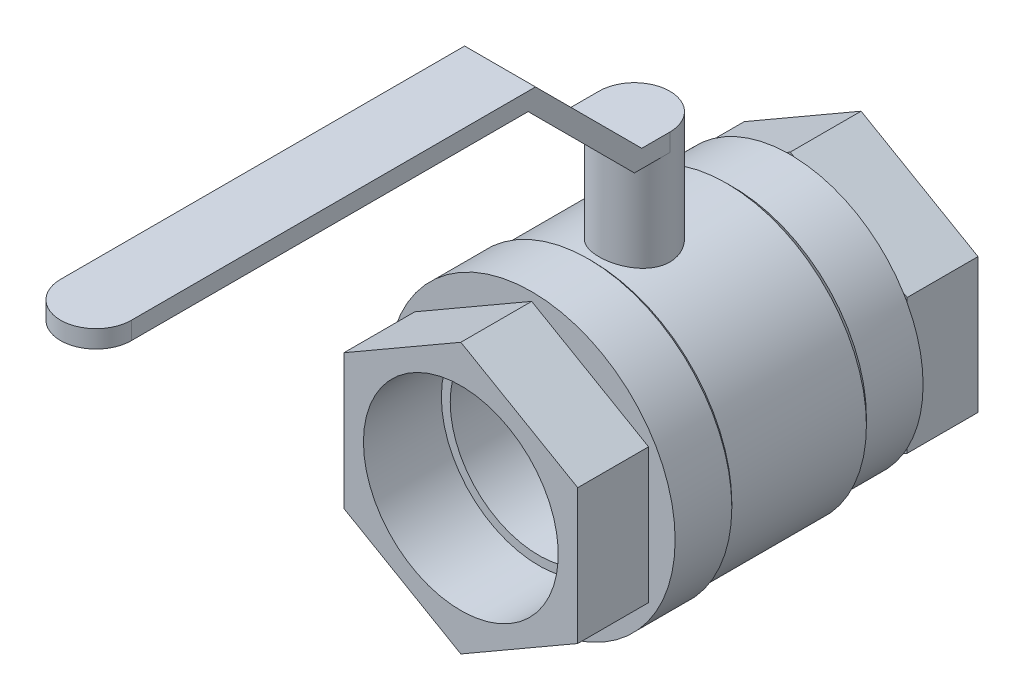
from build123d import *

# Parameters (mm, degrees)
ESQUISSE2_OUTSIDE_W     = 115.182
ESQUISSE2_OUTSIDE_H     = 115.182
ENL_V_MAT_EXTRU_1_DEPTH = 20
ESQUISSE3_OUTSIDE_W     = 115.182
ESQUISSE3_OUTSIDE_H     = 115.182
ENL_V_MAT_EXTRU_3_DEPTH = 20
ESQUISSE7_R             = 10
BOSS_EXTRU_2_DEPTH      = 70
BOSS_EXTRU_MINCE4_DEPTH = 10
ENL_V_MAT_EXTRU_6_DEPTH = 186.409007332


with BuildPart() as part:
    # Esquisse1 → Base-R_volution (revolve)
    with BuildSketch(Plane(origin=(0, 0, 0), x_dir=(1, 0, 0), z_dir=(0, 1, 0)), mode=Mode.PRIVATE) as base_r_volution_sk:
        Polygon((0, 0), (40, 0), (40, 20), (40.5, 20), (40.5, 36), (39.5, 37), (39.5, 75), (37.5, 77), (37.5, 93), (40, 93), (40, 113), (0, 113), align=None)
    revolve(base_r_volution_sk.sketch.rotate(Axis((0, 0, -108), (0, 0, 1)), 180), axis=Axis((0, 0, -108), (0, 0, 1)))

    # Esquisse2 outside → Enl_v. mat.-Extru.1 (cut)
    with BuildSketch(Plane.XY):
        Rectangle(ESQUISSE2_OUTSIDE_W, ESQUISSE2_OUTSIDE_H)
        Polygon((33, -19.052558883), (33, 19.052558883), (0, 38.105117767), (-33, 19.052558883), (-33, -19.052558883), (0, -38.105117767), align=None, mode=Mode.SUBTRACT)
    extrude(amount=-ENL_V_MAT_EXTRU_1_DEPTH, mode=Mode.SUBTRACT)

    # Esquisse3 outside → Enl_v. mat.-Extru.3 (cut)
    with BuildSketch(Plane(origin=(0, 0, -113), x_dir=(-1, 0, 0), z_dir=(0, 0, -1))):
        Rectangle(ESQUISSE3_OUTSIDE_W, ESQUISSE3_OUTSIDE_H)
        Polygon((-33, -19.052558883), (0, -38.105117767), (33, -19.052558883), (33, 19.052558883), (0, 38.105117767), (-33, 19.052558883), align=None, mode=Mode.SUBTRACT)
    extrude(amount=-ENL_V_MAT_EXTRU_3_DEPTH, mode=Mode.SUBTRACT)

    # Esquisse7 → Boss.-Extru.2 (add)
    with BuildSketch(Plane(origin=(0, 0, 0), x_dir=(1, 0, 0), z_dir=(0, 1, 0))):
        with Locations(Location((0, 49, 0), (0, 0, 90))):
            Circle(ESQUISSE7_R)
    extrude(amount=BOSS_EXTRU_2_DEPTH)

    # Esquisse9 → Boss.-Extru.-Mince4 (add, symmetric)
    with BuildSketch(Plane(origin=(0, 0, -49), x_dir=(0, 0, -1), z_dir=(1, 0, 0))):
        Polygon((0, 65), (-10, 65), (-40, 95), (-163, 95), (-163, 100), (-37.928932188, 100), (-7.928932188, 70), (0, 70), align=None)
    extrude(amount=BOSS_EXTRU_MINCE4_DEPTH, both=True)

    # Esquisse10 → Enl_v. mat.-Extru.6 (cut, through all)
    with BuildSketch(Plane(origin=(0, 100, 0), x_dir=(-1, 0, 0), z_dir=(0, 1, 0))):
        with BuildLine():
            Line((-10, 103), (-10, 114))
            Line((-10, 114), (10, 114))
            Line((10, 114), (10, 103))
            ThreePointArc((10, 103), (0, 113), (-10, 103))
        make_face()
    extrude(amount=-ENL_V_MAT_EXTRU_6_DEPTH, mode=Mode.SUBTRACT)

    # Esquisse11 → Enl_vement de mati_re-R_volution1 (revolve, cut)
    with BuildSketch(Plane(origin=(0, 0, 0), x_dir=(1, 0, 0), z_dir=(0, 1, 0))):
        Polygon((-27.5, 113), (-27.5, 91), (-25, 91), (-25, 22), (-27.5, 22), (-27.5, 0), (0, 0), (0, 113), align=None)
    revolve(axis=Axis((0, 0, -64), (0, 0, 1)), mode=Mode.SUBTRACT)


solid = part.part
